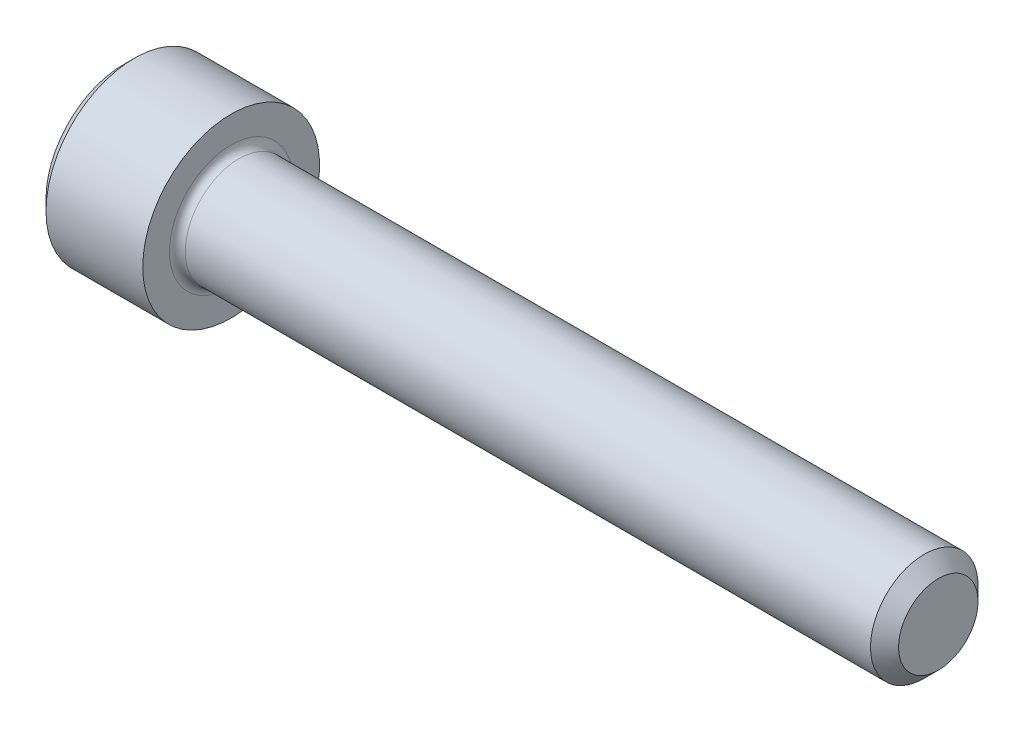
from build123d import *

# Parameters (mm, degrees)
FILLET1_R   = 0.3556
HEX_2_DEPTH = 2.286


with BuildPart() as part:
    # BodySke → Base-Revolve (revolve)
    with BuildSketch(Plane.XY, mode=Mode.PRIVATE) as base_revolve_sk:
        Polygon((0, 0), (0, 3.48615), (0.4826, 3.96875), (4.826, 3.96875), (4.826, 2.413), (35.94608, 2.413), (36.576, 1.78308), (36.576, 0), align=None)
    revolve(base_revolve_sk.sketch.rotate(Axis((-31.75, 0, 0), (1, 0, 0)), 90), axis=Axis((-31.75, 0, 0), (1, 0, 0)))

    # Fillet1
    fillet1_edges = [part.edges().sort_by_distance(p)[0] for p in [
        (4.826, 0, -2.413),
    ]]
    fillet(fillet1_edges, radius=FILLET1_R)

    # Sketch2 → Hex-PreBroach (revolve, cut)
    with BuildSketch(Plane.XY, mode=Mode.PRIVATE) as hex_prebroach_sk:
        Polygon((0, 1.98501), (2.286, 1.98501), (3.432046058, 0), (0, 0), align=None)
    revolve(hex_prebroach_sk.sketch.rotate(Axis((0, 0, 0), (1, 0, 0)), 90), axis=Axis((0, 0, 0), (1, 0, 0)), mode=Mode.SUBTRACT)

    # Sketch3 → Hex 2 (cut)
    with BuildSketch(Plane(origin=(0, 0, 0), x_dir=(0, 0.500000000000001, 0.866025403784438), z_dir=(-1, 0, 0))):
        Polygon((1.146046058, 1.98501), (-1.146046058, 1.98501), (-2.292092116, 0), (-1.146046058, -1.98501), (1.146046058, -1.98501), (2.292092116, 0), align=None)
    extrude(amount=-HEX_2_DEPTH, mode=Mode.SUBTRACT)


solid = part.part
